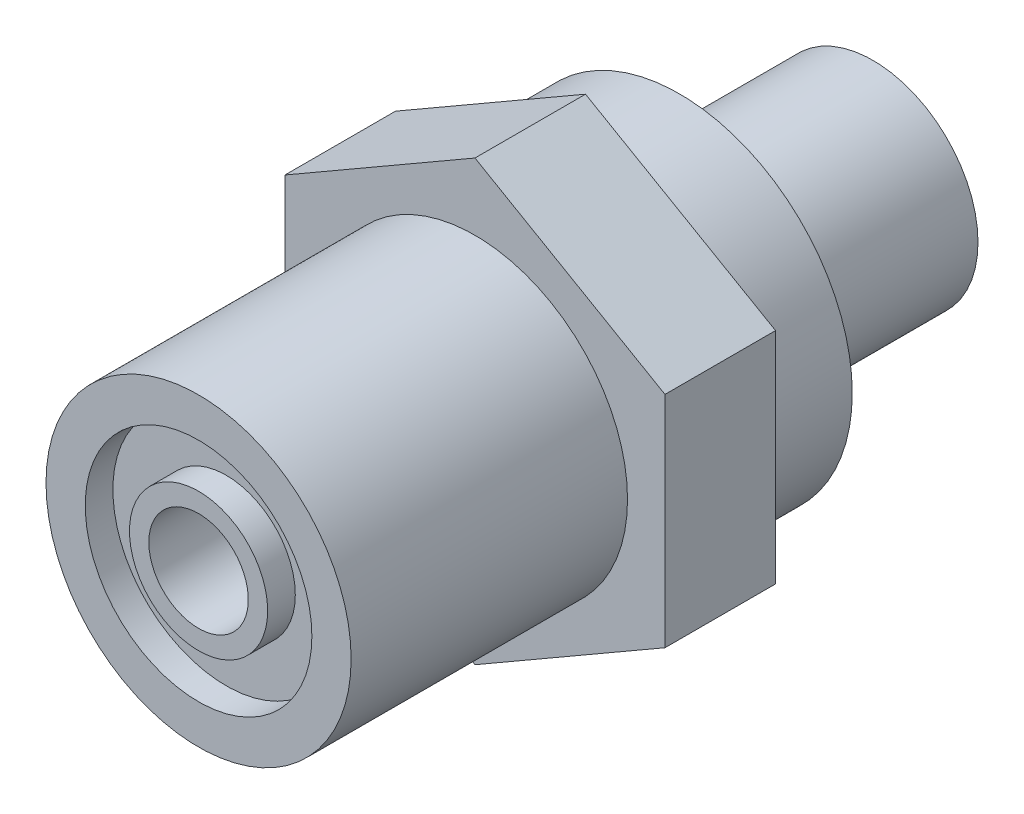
from build123d import *

# Parameters (mm, degrees)
SKETCH1_R           = 4.826
EXTRUDE1_DEPTH      = 8.89
SKETCH2_R           = 7.9375
EXTRUDE2_DEPTH      = 4.318
BOSS_EXTRUDE1_DEPTH = 5.08
SKETCH22_R          = 7.0104
EXTRUDE4_DEPTH      = 12.7
SKETCH23_R          = 2.286
CUT_EXTRUDE1_DEPTH  = 34.736287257
SKETCH24_R          = 5.207
SKETCH24_R_2        = 3.175
CUT_EXTRUDE2_DEPTH  = 1.27


with BuildPart() as part:
    # Sketch1 → Extrude1 (new body)
    with BuildSketch(Plane.XY):
        Circle(SKETCH1_R)
    extrude(amount=EXTRUDE1_DEPTH)

    # Sketch2 → Extrude2 (add)
    with BuildSketch(Plane.XY.offset(8.89)):
        Circle(SKETCH2_R)
    extrude(amount=EXTRUDE2_DEPTH)

    # Sketch21 → Boss-Extrude1 (add)
    with BuildSketch(Plane(origin=(1.524604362, -1.890509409, 13.208), x_dir=(1, 0, 0), z_dir=(0, 0, 1))):
        Polygon((7.206645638, 6.931496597), (7.206645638, -3.150477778), (-1.524600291, -8.191464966), (-10.25584622, -3.150477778), (-10.25584622, 6.931496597), (-1.524600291, 11.972483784), align=None)
    extrude(amount=BOSS_EXTRUDE1_DEPTH)

    # Sketch22 → Extrude4 (add)
    with BuildSketch(Plane.XY.offset(18.288)):
        with Locations(Location((0, 0, 0), (0, 0, 180))):
            Circle(SKETCH22_R)
    extrude(amount=EXTRUDE4_DEPTH)

    # Sketch23 → Cut-Extrude1 (cut, through all)
    with BuildSketch(Plane(origin=(0, 0, 0), x_dir=(-1, 0, 0), z_dir=(0, 0, -1))):
        Circle(SKETCH23_R)
    extrude(amount=-CUT_EXTRUDE1_DEPTH, mode=Mode.SUBTRACT)

    # Sketch24 → Cut-Extrude2 (cut)
    with BuildSketch(Plane.XY.offset(30.988)):
        Circle(SKETCH24_R)
        Circle(SKETCH24_R_2, mode=Mode.SUBTRACT)
    extrude(amount=-CUT_EXTRUDE2_DEPTH, mode=Mode.SUBTRACT)


solid = part.part
